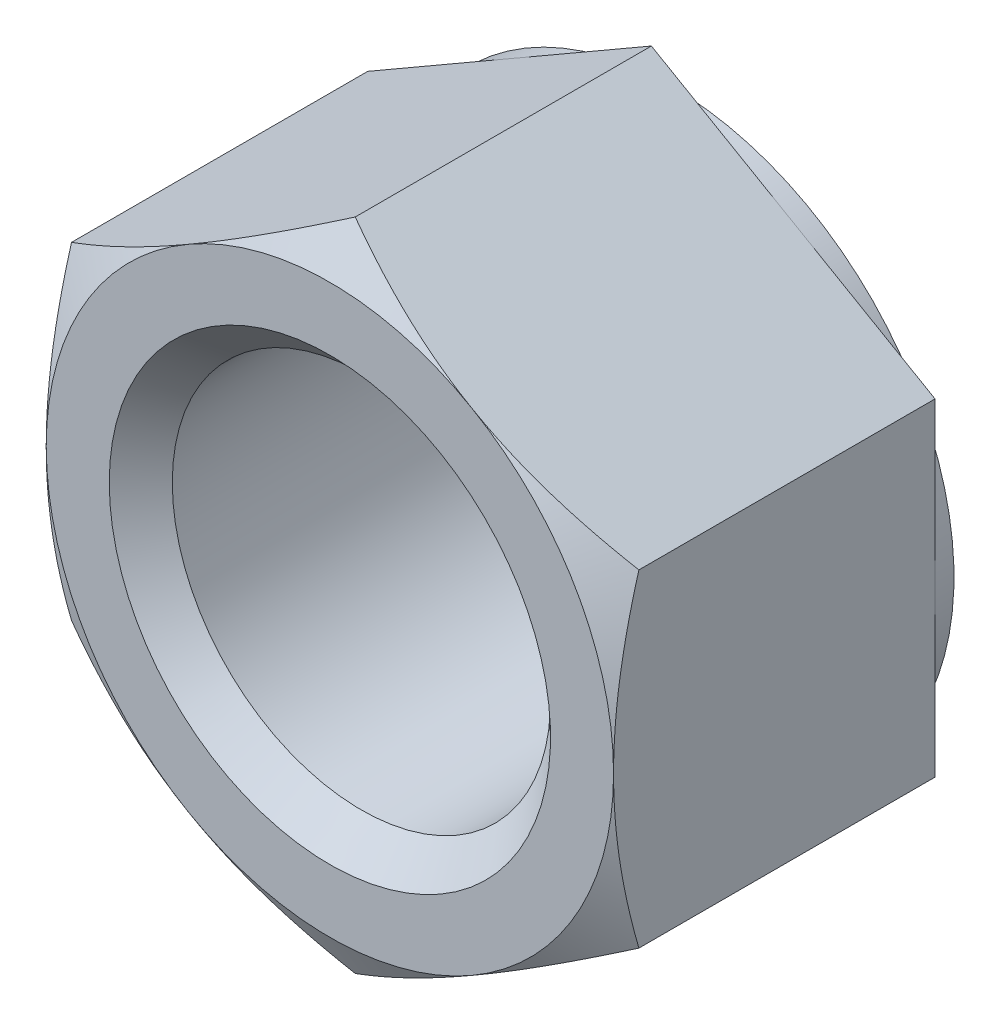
ISO-10303-21;
HEADER;
FILE_DESCRIPTION(('STEP AP214'),'2;1');
FILE_NAME('part.step','',(''),(''),'','','');
FILE_SCHEMA(('AUTOMOTIVE_DESIGN { 1 0 10303 214 1 1 1 1 }'));
ENDSEC;
DATA;
#1=APPLICATION_CONTEXT('core data for automotive mechanical design processes');
#2=APPLICATION_PROTOCOL_DEFINITION('international standard','automotive_design',2000,#1);
#3=PRODUCT_CONTEXT('',#1,'mechanical');
#4=PRODUCT('Part','Part','',(#3));
#5=PRODUCT_RELATED_PRODUCT_CATEGORY('part','',(#4));
#6=PRODUCT_DEFINITION_FORMATION('','',#4);
#7=PRODUCT_DEFINITION_CONTEXT('part definition',#1,'design');
#8=PRODUCT_DEFINITION('design','',#6,#7);
#9=PRODUCT_DEFINITION_SHAPE('','',#8);
#10=(LENGTH_UNIT() NAMED_UNIT(*) SI_UNIT(.MILLI.,.METRE.));
#11=(NAMED_UNIT(*) PLANE_ANGLE_UNIT() SI_UNIT($,.RADIAN.));
#12=(NAMED_UNIT(*) SI_UNIT($,.STERADIAN.) SOLID_ANGLE_UNIT());
#13=UNCERTAINTY_MEASURE_WITH_UNIT(LENGTH_MEASURE(1.E-05),#10,'distance_accuracy_value','');
#14=(GEOMETRIC_REPRESENTATION_CONTEXT(3) GLOBAL_UNCERTAINTY_ASSIGNED_CONTEXT((#13)) GLOBAL_UNIT_ASSIGNED_CONTEXT((#10,
#11,#12)) REPRESENTATION_CONTEXT('',''));
#15=CARTESIAN_POINT('',(0.,0.,0.));
#16=DIRECTION('',(0.,0.,1.));
#17=DIRECTION('',(1.,0.,0.));
#18=AXIS2_PLACEMENT_3D('',#15,#16,#17);
#19=CARTESIAN_POINT('',(0.,10.3923048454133,-10.8));
#20=DIRECTION('',(0.,0.,-1.));
#21=DIRECTION('',(-1.,0.,0.));
#22=AXIS2_PLACEMENT_3D('',#19,#20,#21);
#23=PLANE('',#22);
#24=CARTESIAN_POINT('',(0.,0.,-10.8));
#25=DIRECTION('',(0.,0.,-1.));
#26=DIRECTION('',(-1.,0.,0.));
#27=AXIS2_PLACEMENT_3D('',#24,#25,#26);
#28=CIRCLE('',#27,9.);
#29=CARTESIAN_POINT('',(-9.,0.,-10.8));
#30=VERTEX_POINT('',#29);
#31=EDGE_CURVE('E280',#30,#30,#28,.F.);
#32=ORIENTED_EDGE('',*,*,#31,.F.);
#33=EDGE_LOOP('',(#32));
#34=FACE_BOUND('',#33,.T.);
#35=CARTESIAN_POINT('',(0.,0.,-10.8));
#36=DIRECTION('',(0.,0.,-1.));
#37=DIRECTION('',(-1.,0.,0.));
#38=AXIS2_PLACEMENT_3D('',#35,#36,#37);
#39=CIRCLE('',#38,6.);
#40=CARTESIAN_POINT('',(-6.,0.,-10.8));
#41=VERTEX_POINT('',#40);
#42=EDGE_CURVE('E148',#41,#41,#39,.F.);
#43=ORIENTED_EDGE('',*,*,#42,.T.);
#44=EDGE_LOOP('',(#43));
#45=FACE_BOUND('',#44,.T.);
#46=ADVANCED_FACE('F33',(#34,#45),#23,.T.);
#47=CARTESIAN_POINT('',(0.,10.3923048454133,0.));
#48=DIRECTION('',(0.,0.,-1.));
#49=DIRECTION('',(-1.,0.,0.));
#50=AXIS2_PLACEMENT_3D('',#47,#48,#49);
#51=PLANE('',#50);
#52=CARTESIAN_POINT('',(0.,0.,0.));
#53=DIRECTION('',(0.,0.,-1.));
#54=DIRECTION('',(-1.,0.,0.));
#55=AXIS2_PLACEMENT_3D('',#52,#53,#54);
#56=CIRCLE('',#55,7.);
#57=CARTESIAN_POINT('',(-7.,0.,0.));
#58=VERTEX_POINT('',#57);
#59=EDGE_CURVE('E12',#58,#58,#56,.T.);
#60=ORIENTED_EDGE('',*,*,#59,.T.);
#61=EDGE_LOOP('',(#60));
#62=FACE_BOUND('',#61,.T.);
#63=CARTESIAN_POINT('',(0.,0.,0.));
#64=DIRECTION('',(0.,0.,-1.));
#65=DIRECTION('',(-1.,0.,0.));
#66=AXIS2_PLACEMENT_3D('',#63,#64,#65);
#67=CIRCLE('',#66,9.);
#68=CARTESIAN_POINT('',(-4.50000000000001,7.79422863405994,0.));
#69=VERTEX_POINT('',#68);
#70=CARTESIAN_POINT('',(-9.,0.,0.));
#71=VERTEX_POINT('',#70);
#72=EDGE_CURVE('E297',#69,#71,#67,.F.);
#73=ORIENTED_EDGE('',*,*,#72,.T.);
#74=CARTESIAN_POINT('',(-4.50000000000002,-7.79422863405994,0.));
#75=VERTEX_POINT('',#74);
#76=EDGE_CURVE('E48',#71,#75,#67,.F.);
#77=ORIENTED_EDGE('',*,*,#76,.T.);
#78=CARTESIAN_POINT('',(4.50000000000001,-7.79422863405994,0.));
#79=VERTEX_POINT('',#78);
#80=EDGE_CURVE('E153',#75,#79,#67,.F.);
#81=ORIENTED_EDGE('',*,*,#80,.T.);
#82=CARTESIAN_POINT('',(9.,0.,0.));
#83=VERTEX_POINT('',#82);
#84=EDGE_CURVE('E127',#79,#83,#67,.F.);
#85=ORIENTED_EDGE('',*,*,#84,.T.);
#86=CARTESIAN_POINT('',(0.,0.,0.));
#87=DIRECTION('',(0.,0.,1.));
#88=DIRECTION('',(1.,0.,0.));
#89=AXIS2_PLACEMENT_3D('',#86,#87,#88);
#90=CIRCLE('',#89,9.);
#91=CARTESIAN_POINT('',(4.50000000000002,7.79422863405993,0.));
#92=VERTEX_POINT('',#91);
#93=EDGE_CURVE('E139',#83,#92,#90,.T.);
#94=ORIENTED_EDGE('',*,*,#93,.T.);
#95=EDGE_CURVE('E154',#92,#69,#67,.F.);
#96=ORIENTED_EDGE('',*,*,#95,.T.);
#97=EDGE_LOOP('',(#73,#77,#81,#85,#94,#96));
#98=FACE_BOUND('',#97,.T.);
#99=ADVANCED_FACE('F151',(#62,#98),#51,.F.);
#100=CARTESIAN_POINT('',(0.,10.3923048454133,-10.8));
#101=DIRECTION('',(-0.500000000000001,0.866025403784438,0.));
#102=DIRECTION('',(-0.866025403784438,-0.500000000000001,0.));
#103=AXIS2_PLACEMENT_3D('',#100,#101,#102);
#104=PLANE('',#103);
#105=DIRECTION('',(0.,0.,1.));
#106=VECTOR('',#105,1.);
#107=CARTESIAN_POINT('',(-9.,5.19615242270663,-10.8));
#108=LINE('',#107,#106);
#109=CARTESIAN_POINT('',(-9.,5.19615242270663,-10.2));
#110=VERTEX_POINT('',#109);
#111=CARTESIAN_POINT('',(-9.,5.19615242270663,-0.803847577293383));
#112=VERTEX_POINT('',#111);
#113=EDGE_CURVE('E290',#110,#112,#108,.T.);
#114=ORIENTED_EDGE('',*,*,#113,.T.);
#115=CARTESIAN_POINT('',(-9.0002,5.19603695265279,-0.803914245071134));
#116=CARTESIAN_POINT('',(-8.80239295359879,5.31024090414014,-0.737982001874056));
#117=CARTESIAN_POINT('',(-8.60381439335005,5.42489028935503,-0.675041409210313));
#118=CARTESIAN_POINT('',(-8.20504463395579,5.65512011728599,-0.555968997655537));
#119=CARTESIAN_POINT('',(-8.00485277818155,5.77070093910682,-0.499840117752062));
#120=CARTESIAN_POINT('',(-7.6024849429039,6.00300811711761,-0.395151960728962));
#121=CARTESIAN_POINT('',(-7.4003054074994,6.11973652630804,-0.346610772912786));
#122=CARTESIAN_POINT('',(-6.99457124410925,6.35398725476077,-0.258148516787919));
#123=CARTESIAN_POINT('',(-6.79101690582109,6.47150940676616,-0.218225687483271));
#124=CARTESIAN_POINT('',(-6.38769409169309,6.70436794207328,-0.148684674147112));
#125=CARTESIAN_POINT('',(-6.187955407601,6.81968712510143,-0.118837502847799));
#126=CARTESIAN_POINT('',(-5.787584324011,7.05084147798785,-0.0687933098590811));
#127=CARTESIAN_POINT('',(-5.58695200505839,7.16667660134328,-0.0485954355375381));
#128=CARTESIAN_POINT('',(-5.18533936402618,7.39854776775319,-0.0183543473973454));
#129=CARTESIAN_POINT('',(-4.98435969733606,7.51458343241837,-0.0082996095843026));
#130=CARTESIAN_POINT('',(-4.58221540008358,7.74676155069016,0.00143766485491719));
#131=CARTESIAN_POINT('',(-4.38105077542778,7.86290400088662,0.00112052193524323));
#132=CARTESIAN_POINT('',(-4.0049673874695,8.08003584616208,-0.00916395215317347));
#133=CARTESIAN_POINT('',(-3.83002210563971,8.18104055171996,-0.017876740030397));
#134=CARTESIAN_POINT('',(-3.48054132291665,8.38281337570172,-0.0429773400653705));
#135=CARTESIAN_POINT('',(-3.30600585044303,8.48358147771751,-0.0593656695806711));
#136=CARTESIAN_POINT('',(-2.78307512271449,8.7854956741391,-0.119656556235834));
#137=CARTESIAN_POINT('',(-2.43560548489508,8.98610736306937,-0.174677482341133));
#138=CARTESIAN_POINT('',(-1.736980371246,9.3894587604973,-0.312230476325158));
#139=CARTESIAN_POINT('',(-1.38591405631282,9.59214699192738,-0.395345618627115));
#140=CARTESIAN_POINT('',(-0.689016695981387,9.99450087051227,-0.583982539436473));
#141=CARTESIAN_POINT('',(-0.343176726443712,10.1941716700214,-0.68946001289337));
#142=CARTESIAN_POINT('',(0.000200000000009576,10.3924203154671,-0.803914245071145));
#143=B_SPLINE_CURVE_WITH_KNOTS('',3,(#115,#116,#117,#118,#119,#120,#121,#122,#123,#124,#125,
#126,#127,#128,#129,#130,#131,#132,#133,#134,#135,#136,#137,#138,#139,#140,#141,#142),
.UNSPECIFIED.,.F.,.F.,(4,2,2,2,2,2,2,2,2,2,2,2,2,4),(0.,0.713219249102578,1.42674513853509,
2.14194697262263,2.85700253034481,3.55449749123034,4.25193080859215,4.94857085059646,
5.64518936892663,6.25162976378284,6.85811104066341,8.07193747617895,9.31268391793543,
10.5509947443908),.UNSPECIFIED.);
#144=EDGE_CURVE('E55',#112,#69,#143,.T.);
#145=ORIENTED_EDGE('',*,*,#144,.T.);
#146=CARTESIAN_POINT('',(0.,10.3923048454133,-0.80384757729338));
#147=VERTEX_POINT('',#146);
#148=EDGE_CURVE('E164',#69,#147,#143,.T.);
#149=ORIENTED_EDGE('',*,*,#148,.T.);
#150=DIRECTION('',(0.,0.,1.));
#151=VECTOR('',#150,1.);
#152=CARTESIAN_POINT('',(0.,10.3923048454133,-10.8));
#153=LINE('',#152,#151);
#154=CARTESIAN_POINT('',(0.,10.3923048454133,-10.2));
#155=VERTEX_POINT('',#154);
#156=EDGE_CURVE('E277',#155,#147,#153,.T.);
#157=ORIENTED_EDGE('',*,*,#156,.F.);
#158=DIRECTION('',(-0.866025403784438,-0.500000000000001,0.));
#159=VECTOR('',#158,1.);
#160=CARTESIAN_POINT('',(0.,10.3923048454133,-10.2));
#161=LINE('',#160,#159);
#162=CARTESIAN_POINT('',(-4.50000000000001,7.79422863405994,-10.2));
#163=VERTEX_POINT('',#162);
#164=EDGE_CURVE('E265',#155,#163,#161,.T.);
#165=ORIENTED_EDGE('',*,*,#164,.T.);
#166=EDGE_CURVE('E261',#163,#110,#161,.T.);
#167=ORIENTED_EDGE('',*,*,#166,.T.);
#168=EDGE_LOOP('',(#114,#145,#149,#157,#165,#167));
#169=FACE_BOUND('',#168,.T.);
#170=ADVANCED_FACE('F226',(#169),#104,.T.);
#171=CARTESIAN_POINT('',(9.,5.19615242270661,-10.8));
#172=DIRECTION('',(0.500000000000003,0.866025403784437,0.));
#173=DIRECTION('',(-0.866025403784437,0.500000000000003,0.));
#174=AXIS2_PLACEMENT_3D('',#171,#172,#173);
#175=PLANE('',#174);
#176=ORIENTED_EDGE('',*,*,#156,.T.);
#177=CARTESIAN_POINT('',(-0.000199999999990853,10.3924203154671,-0.803914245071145));
#178=CARTESIAN_POINT('',(0.197607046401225,10.2782163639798,-0.737982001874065));
#179=CARTESIAN_POINT('',(0.396185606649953,10.1635669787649,-0.675041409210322));
#180=CARTESIAN_POINT('',(0.794955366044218,9.93333715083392,-0.555968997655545));
#181=CARTESIAN_POINT('',(0.99514722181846,9.81775632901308,-0.499840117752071));
#182=CARTESIAN_POINT('',(1.39751505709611,9.58544915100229,-0.395151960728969));
#183=CARTESIAN_POINT('',(1.59969459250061,9.46872074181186,-0.346610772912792));
#184=CARTESIAN_POINT('',(2.00542875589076,9.23447001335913,-0.258148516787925));
#185=CARTESIAN_POINT('',(2.20898309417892,9.11694786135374,-0.218225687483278));
#186=CARTESIAN_POINT('',(2.61230590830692,8.88408932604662,-0.148684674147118));
#187=CARTESIAN_POINT('',(2.81204459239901,8.76877014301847,-0.118837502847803));
#188=CARTESIAN_POINT('',(3.212415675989,8.53761579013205,-0.0687933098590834));
#189=CARTESIAN_POINT('',(3.41304799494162,8.42178066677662,-0.0485954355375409));
#190=CARTESIAN_POINT('',(3.81466063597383,8.18990950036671,-0.0183543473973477));
#191=CARTESIAN_POINT('',(4.01564030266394,8.07387383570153,-0.00829960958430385));
#192=CARTESIAN_POINT('',(4.41778459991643,7.84169571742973,0.00143766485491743));
#193=CARTESIAN_POINT('',(4.61894922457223,7.72555326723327,0.00112052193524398));
#194=CARTESIAN_POINT('',(4.99503261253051,7.50842142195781,-0.00916395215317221));
#195=CARTESIAN_POINT('',(5.1699778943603,7.40741671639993,-0.0178767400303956));
#196=CARTESIAN_POINT('',(5.51945867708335,7.20564389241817,-0.0429773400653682));
#197=CARTESIAN_POINT('',(5.69399414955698,7.10487579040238,-0.059365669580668));
#198=CARTESIAN_POINT('',(6.21692487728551,6.80296159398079,-0.119656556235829));
#199=CARTESIAN_POINT('',(6.56439451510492,6.60234990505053,-0.174677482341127));
#200=CARTESIAN_POINT('',(7.26301962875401,6.19899850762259,-0.31223047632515));
#201=CARTESIAN_POINT('',(7.61408594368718,5.99631027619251,-0.395345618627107));
#202=CARTESIAN_POINT('',(8.31098330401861,5.59395639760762,-0.583982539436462));
#203=CARTESIAN_POINT('',(8.65682327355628,5.39428559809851,-0.689460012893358));
#204=CARTESIAN_POINT('',(9.0002,5.19603695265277,-0.803914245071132));
#205=B_SPLINE_CURVE_WITH_KNOTS('',3,(#177,#178,#179,#180,#181,#182,#183,#184,#185,#186,#187,
#188,#189,#190,#191,#192,#193,#194,#195,#196,#197,#198,#199,#200,#201,#202,#203,#204),
.UNSPECIFIED.,.F.,.F.,(4,2,2,2,2,2,2,2,2,2,2,2,2,4),(0.,0.713219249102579,1.42674513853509,
2.14194697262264,2.85700253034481,3.55449749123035,4.25193080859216,4.94857085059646,
5.64518936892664,6.25162976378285,6.85811104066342,8.07193747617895,9.31268391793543,
10.5509947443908),.UNSPECIFIED.);
#206=EDGE_CURVE('E161',#147,#92,#205,.T.);
#207=ORIENTED_EDGE('',*,*,#206,.T.);
#208=CARTESIAN_POINT('',(9.,5.19615242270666,-0.80384757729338));
#209=VERTEX_POINT('',#208);
#210=EDGE_CURVE('E142',#92,#209,#205,.T.);
#211=ORIENTED_EDGE('',*,*,#210,.T.);
#212=DIRECTION('',(0.,0.,1.));
#213=VECTOR('',#212,1.);
#214=CARTESIAN_POINT('',(9.,5.19615242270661,-10.8));
#215=LINE('',#214,#213);
#216=CARTESIAN_POINT('',(9.,5.19615242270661,-10.2));
#217=VERTEX_POINT('',#216);
#218=EDGE_CURVE('E160',#217,#209,#215,.T.);
#219=ORIENTED_EDGE('',*,*,#218,.F.);
#220=DIRECTION('',(-0.866025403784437,0.500000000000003,0.));
#221=VECTOR('',#220,1.);
#222=CARTESIAN_POINT('',(9.,5.19615242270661,-10.2));
#223=LINE('',#222,#221);
#224=CARTESIAN_POINT('',(4.50000000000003,7.79422863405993,-10.2));
#225=VERTEX_POINT('',#224);
#226=EDGE_CURVE('E273',#217,#225,#223,.T.);
#227=ORIENTED_EDGE('',*,*,#226,.T.);
#228=EDGE_CURVE('E269',#225,#155,#223,.T.);
#229=ORIENTED_EDGE('',*,*,#228,.T.);
#230=EDGE_LOOP('',(#176,#207,#211,#219,#227,#229));
#231=FACE_BOUND('',#230,.T.);
#232=ADVANCED_FACE('F229',(#231),#175,.T.);
#233=CARTESIAN_POINT('',(9.,5.19615242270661,-10.8));
#234=DIRECTION('',(-1.,0.,0.));
#235=DIRECTION('',(0.,0.,1.));
#236=AXIS2_PLACEMENT_3D('',#233,#234,#235);
#237=PLANE('',#236);
#238=CARTESIAN_POINT('',(9.,-13.7809619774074,-4.30674034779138));
#239=CARTESIAN_POINT('',(9.,-13.5833938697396,-4.21123885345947));
#240=CARTESIAN_POINT('',(9.,-13.385586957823,-4.11623162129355));
#241=CARTESIAN_POINT('',(9.,-12.9894450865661,-3.92731913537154));
#242=CARTESIAN_POINT('',(9.,-12.7911101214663,-3.83341389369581));
#243=CARTESIAN_POINT('',(9.,-12.1951793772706,-3.55349411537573));
#244=CARTESIAN_POINT('',(9.,-11.796721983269,-3.36930666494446));
#245=CARTESIAN_POINT('',(9.,-10.9947735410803,-3.00593915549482));
#246=CARTESIAN_POINT('',(9.,-10.5912667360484,-2.82679378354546));
#247=CARTESIAN_POINT('',(9.,-9.78093737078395,-2.47619472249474));
#248=CARTESIAN_POINT('',(9.,-9.37411498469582,-2.30474063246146));
#249=CARTESIAN_POINT('',(9.,-8.55145586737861,-1.96953872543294));
#250=CARTESIAN_POINT('',(9.,-8.13556978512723,-1.80591135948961));
#251=CARTESIAN_POINT('',(9.,-7.2988933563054,-1.491471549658));
#252=CARTESIAN_POINT('',(9.,-6.87810247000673,-1.3406605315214));
#253=CARTESIAN_POINT('',(9.,-6.03180598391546,-1.05590655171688));
#254=CARTESIAN_POINT('',(9.,-5.60631258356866,-0.921927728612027));
#255=CARTESIAN_POINT('',(9.,-4.74929212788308,-0.675187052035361));
#256=CARTESIAN_POINT('',(9.,-4.31776702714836,-0.56241848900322));
#257=CARTESIAN_POINT('',(9.,-3.44831631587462,-0.363581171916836));
#258=CARTESIAN_POINT('',(9.,-3.01038903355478,-0.277519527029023));
#259=CARTESIAN_POINT('',(9.,-2.34964451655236,-0.172766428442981));
#260=CARTESIAN_POINT('',(9.,-2.12872697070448,-0.141903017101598));
#261=CARTESIAN_POINT('',(9.,-1.68585612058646,-0.0888965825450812));
#262=CARTESIAN_POINT('',(9.,-1.46390292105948,-0.0667526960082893));
#263=CARTESIAN_POINT('',(9.,-1.02066876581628,-0.0317812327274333));
#264=CARTESIAN_POINT('',(9.,-0.799392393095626,-0.0188958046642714));
#265=CARTESIAN_POINT('',(9.,-0.356492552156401,-0.00250938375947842));
#266=CARTESIAN_POINT('',(9.,-0.134869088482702,0.000991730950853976));
#267=CARTESIAN_POINT('',(9.,0.308263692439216,-0.001473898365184));
#268=CARTESIAN_POINT('',(9.,0.529773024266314,-0.0074379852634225));
#269=CARTESIAN_POINT('',(9.,0.972347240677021,-0.0286857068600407));
#270=CARTESIAN_POINT('',(9.,1.19341210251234,-0.0439698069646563));
#271=CARTESIAN_POINT('',(9.,1.72920526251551,-0.0919895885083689));
#272=CARTESIAN_POINT('',(9.,2.04352190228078,-0.12939492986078));
#273=CARTESIAN_POINT('',(9.,2.66974660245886,-0.220970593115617));
#274=CARTESIAN_POINT('',(9.,2.98165398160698,-0.275145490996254));
#275=CARTESIAN_POINT('',(9.,3.60280284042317,-0.398338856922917));
#276=CARTESIAN_POINT('',(9.,3.91204150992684,-0.467371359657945));
#277=CARTESIAN_POINT('',(9.,4.5273372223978,-0.618173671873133));
#278=CARTESIAN_POINT('',(9.,4.83339456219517,-0.699942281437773));
#279=CARTESIAN_POINT('',(9.,5.44986573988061,-0.876398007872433));
#280=CARTESIAN_POINT('',(9.,5.7602024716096,-0.971352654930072));
#281=CARTESIAN_POINT('',(9.,6.3775956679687,-1.17064401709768));
#282=CARTESIAN_POINT('',(9.,6.68465423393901,-1.27497426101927));
#283=CARTESIAN_POINT('',(9.,7.29425898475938,-1.49086177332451));
#284=CARTESIAN_POINT('',(9.,7.59682084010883,-1.60237505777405));
#285=CARTESIAN_POINT('',(9.,8.19959709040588,-1.83194682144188));
#286=CARTESIAN_POINT('',(9.,8.49981047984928,-1.95000794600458));
#287=CARTESIAN_POINT('',(9.,8.79893322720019,-2.07069526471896));
#288=B_SPLINE_CURVE_WITH_KNOTS('',3,(#238,#239,#240,#241,#242,#243,#244,#245,#246,#247,#248,
#249,#250,#251,#252,#253,#254,#255,#256,#257,#258,#259,#260,#261,#262,#263,#264,#265,#266,#267,
#268,#269,#270,#271,#272,#273,#274,#275,#276,#277,#278,#279,#280,#281,#282,#283,#284,#285,#286,
#287),.UNSPECIFIED.,.F.,.F.,(4,2,2,2,2,2,2,2,2,2,2,2,2,2,2,2,2,2,2,2,2,2,2,2,4),(0.,
0.658317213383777,1.31664163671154,2.63350462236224,3.95790348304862,5.28223322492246,
6.62282162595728,7.96355896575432,9.30138955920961,10.6387962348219,11.9765586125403,
12.6456025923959,13.3145803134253,13.9793407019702,14.644092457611,15.3086576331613,
15.9732559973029,16.9223307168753,17.8716646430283,18.82189928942,19.7720444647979,
20.745479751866,21.7182482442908,22.6855413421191,23.6532281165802),.UNSPECIFIED.);
#289=CARTESIAN_POINT('',(9.,-5.19615242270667,-0.80384757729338));
#290=VERTEX_POINT('',#289);
#291=EDGE_CURVE('E123',#290,#83,#288,.T.);
#292=ORIENTED_EDGE('',*,*,#291,.F.);
#293=DIRECTION('',(0.,0.,1.));
#294=VECTOR('',#293,1.);
#295=CARTESIAN_POINT('',(9.,-5.19615242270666,-10.8));
#296=LINE('',#295,#294);
#297=CARTESIAN_POINT('',(9.,-5.19615242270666,-10.2));
#298=VERTEX_POINT('',#297);
#299=EDGE_CURVE('E282',#298,#290,#296,.T.);
#300=ORIENTED_EDGE('',*,*,#299,.F.);
#301=DIRECTION('',(0.,-1.,0.));
#302=VECTOR('',#301,1.);
#303=CARTESIAN_POINT('',(9.,5.19615242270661,-10.2));
#304=LINE('',#303,#302);
#305=CARTESIAN_POINT('',(9.,0.,-10.2));
#306=VERTEX_POINT('',#305);
#307=EDGE_CURVE('E274',#306,#298,#304,.T.);
#308=ORIENTED_EDGE('',*,*,#307,.F.);
#309=EDGE_CURVE('E276',#217,#306,#304,.T.);
#310=ORIENTED_EDGE('',*,*,#309,.F.);
#311=ORIENTED_EDGE('',*,*,#218,.T.);
#312=EDGE_CURVE('E136',#83,#209,#288,.T.);
#313=ORIENTED_EDGE('',*,*,#312,.F.);
#314=EDGE_LOOP('',(#292,#300,#308,#310,#311,#313));
#315=FACE_BOUND('',#314,.T.);
#316=ADVANCED_FACE('F157',(#315),#237,.F.);
#317=CARTESIAN_POINT('',(0.,-10.3923048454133,-10.8));
#318=DIRECTION('',(0.500000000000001,-0.866025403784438,0.));
#319=DIRECTION('',(0.866025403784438,0.500000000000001,0.));
#320=AXIS2_PLACEMENT_3D('',#317,#318,#319);
#321=PLANE('',#320);
#322=ORIENTED_EDGE('',*,*,#299,.T.);
#323=CARTESIAN_POINT('',(9.0002,-5.19603695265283,-0.803914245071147));
#324=CARTESIAN_POINT('',(8.80239295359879,-5.31024090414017,-0.737982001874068));
#325=CARTESIAN_POINT('',(8.60381439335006,-5.42489028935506,-0.675041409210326));
#326=CARTESIAN_POINT('',(8.20504463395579,-5.65512011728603,-0.55596899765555));
#327=CARTESIAN_POINT('',(8.00485277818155,-5.77070093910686,-0.499840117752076));
#328=CARTESIAN_POINT('',(7.6024849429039,-6.00300811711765,-0.395151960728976));
#329=CARTESIAN_POINT('',(7.4003054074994,-6.11973652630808,-0.346610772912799));
#330=CARTESIAN_POINT('',(6.99457124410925,-6.35398725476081,-0.258148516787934));
#331=CARTESIAN_POINT('',(6.79101690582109,-6.4715094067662,-0.218225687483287));
#332=CARTESIAN_POINT('',(6.38769409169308,-6.70436794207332,-0.148684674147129));
#333=CARTESIAN_POINT('',(6.18795540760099,-6.81968712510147,-0.118837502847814));
#334=CARTESIAN_POINT('',(5.787584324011,-7.05084147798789,-0.0687933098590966));
#335=CARTESIAN_POINT('',(5.58695200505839,-7.16667660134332,-0.0485954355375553));
#336=CARTESIAN_POINT('',(5.18533936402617,-7.39854776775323,-0.0183543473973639));
#337=CARTESIAN_POINT('',(4.98435969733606,-7.51458343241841,-0.00829960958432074));
#338=CARTESIAN_POINT('',(4.58221540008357,-7.74676155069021,0.00143766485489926));
#339=CARTESIAN_POINT('',(4.38105077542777,-7.86290400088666,0.00112052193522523));
#340=CARTESIAN_POINT('',(4.00496738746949,-8.08003584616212,-0.00916395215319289));
#341=CARTESIAN_POINT('',(3.8300221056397,-8.18104055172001,-0.0178767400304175));
#342=CARTESIAN_POINT('',(3.48054132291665,-8.38281337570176,-0.0429773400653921));
#343=CARTESIAN_POINT('',(3.30600585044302,-8.48358147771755,-0.0593656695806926));
#344=CARTESIAN_POINT('',(2.78307512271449,-8.78549567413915,-0.119656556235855));
#345=CARTESIAN_POINT('',(2.43560548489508,-8.9861073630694,-0.174677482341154));
#346=CARTESIAN_POINT('',(1.736980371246,-9.38945876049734,-0.312230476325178));
#347=CARTESIAN_POINT('',(1.38591405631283,-9.59214699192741,-0.395345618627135));
#348=CARTESIAN_POINT('',(0.689016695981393,-9.9945008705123,-0.583982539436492));
#349=CARTESIAN_POINT('',(0.34317672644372,-10.1941716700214,-0.689460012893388));
#350=CARTESIAN_POINT('',(-0.00020000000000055,-10.3924203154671,-0.803914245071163));
#351=B_SPLINE_CURVE_WITH_KNOTS('',3,(#323,#324,#325,#326,#327,#328,#329,#330,#331,#332,#333,
#334,#335,#336,#337,#338,#339,#340,#341,#342,#343,#344,#345,#346,#347,#348,#349,#350),
.UNSPECIFIED.,.F.,.F.,(4,2,2,2,2,2,2,2,2,2,2,2,2,4),(0.,0.713219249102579,1.42674513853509,
2.14194697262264,2.85700253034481,3.55449749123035,4.25193080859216,4.94857085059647,
5.64518936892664,6.25162976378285,6.85811104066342,8.07193747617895,9.31268391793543,
10.5509947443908),.UNSPECIFIED.);
#352=EDGE_CURVE('E130',#290,#79,#351,.T.);
#353=ORIENTED_EDGE('',*,*,#352,.T.);
#354=CARTESIAN_POINT('',(0.,-10.3923048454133,-0.80384757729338));
#355=VERTEX_POINT('',#354);
#356=EDGE_CURVE('E172',#79,#355,#351,.T.);
#357=ORIENTED_EDGE('',*,*,#356,.T.);
#358=DIRECTION('',(0.,0.,1.));
#359=VECTOR('',#358,1.);
#360=CARTESIAN_POINT('',(0.,-10.3923048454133,-10.8));
#361=LINE('',#360,#359);
#362=CARTESIAN_POINT('',(0.,-10.3923048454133,-10.2));
#363=VERTEX_POINT('',#362);
#364=EDGE_CURVE('E284',#363,#355,#361,.T.);
#365=ORIENTED_EDGE('',*,*,#364,.F.);
#366=DIRECTION('',(0.866025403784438,0.500000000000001,0.));
#367=VECTOR('',#366,1.);
#368=CARTESIAN_POINT('',(0.,-10.3923048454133,-10.2));
#369=LINE('',#368,#367);
#370=CARTESIAN_POINT('',(4.50000000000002,-7.79422863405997,-10.2));
#371=VERTEX_POINT('',#370);
#372=EDGE_CURVE('E266',#363,#371,#369,.T.);
#373=ORIENTED_EDGE('',*,*,#372,.T.);
#374=EDGE_CURVE('E270',#371,#298,#369,.T.);
#375=ORIENTED_EDGE('',*,*,#374,.T.);
#376=EDGE_LOOP('',(#322,#353,#357,#365,#373,#375));
#377=FACE_BOUND('',#376,.T.);
#378=ADVANCED_FACE('F219',(#377),#321,.T.);
#379=CARTESIAN_POINT('',(-9.,-5.19615242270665,-10.8));
#380=DIRECTION('',(-0.500000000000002,-0.866025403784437,0.));
#381=DIRECTION('',(0.866025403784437,-0.500000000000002,0.));
#382=AXIS2_PLACEMENT_3D('',#379,#380,#381);
#383=PLANE('',#382);
#384=ORIENTED_EDGE('',*,*,#364,.T.);
#385=CARTESIAN_POINT('',(0.000199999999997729,-10.3924203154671,-0.803914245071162));
#386=CARTESIAN_POINT('',(-0.197607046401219,-10.2782163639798,-0.737982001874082));
#387=CARTESIAN_POINT('',(-0.396185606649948,-10.1635669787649,-0.675041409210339));
#388=CARTESIAN_POINT('',(-0.794955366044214,-9.93333715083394,-0.555968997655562));
#389=CARTESIAN_POINT('',(-0.995147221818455,-9.81775632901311,-0.499840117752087));
#390=CARTESIAN_POINT('',(-1.3975150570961,-9.58544915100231,-0.395151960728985));
#391=CARTESIAN_POINT('',(-1.5996945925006,-9.46872074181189,-0.346610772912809));
#392=CARTESIAN_POINT('',(-2.00542875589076,-9.23447001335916,-0.258148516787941));
#393=CARTESIAN_POINT('',(-2.20898309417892,-9.11694786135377,-0.218225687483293));
#394=CARTESIAN_POINT('',(-2.61230590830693,-8.88408932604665,-0.148684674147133));
#395=CARTESIAN_POINT('',(-2.81204459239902,-8.7687701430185,-0.118837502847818));
#396=CARTESIAN_POINT('',(-3.21241567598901,-8.53761579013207,-0.0687933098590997));
#397=CARTESIAN_POINT('',(-3.41304799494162,-8.42178066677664,-0.0485954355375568));
#398=CARTESIAN_POINT('',(-3.81466063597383,-8.18990950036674,-0.0183543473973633));
#399=CARTESIAN_POINT('',(-4.01564030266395,-8.07387383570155,-0.00829960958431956));
#400=CARTESIAN_POINT('',(-4.41778459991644,-7.84169571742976,0.00143766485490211));
#401=CARTESIAN_POINT('',(-4.61894922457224,-7.7255532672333,0.00112052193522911));
#402=CARTESIAN_POINT('',(-4.99503261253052,-7.50842142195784,-0.00916395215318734));
#403=CARTESIAN_POINT('',(-5.16997789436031,-7.40741671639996,-0.0178767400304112));
#404=CARTESIAN_POINT('',(-5.51945867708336,-7.2056438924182,-0.0429773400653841));
#405=CARTESIAN_POINT('',(-5.69399414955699,-7.10487579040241,-0.0593656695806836));
#406=CARTESIAN_POINT('',(-6.21692487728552,-6.80296159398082,-0.119656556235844));
#407=CARTESIAN_POINT('',(-6.56439451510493,-6.60234990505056,-0.174677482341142));
#408=CARTESIAN_POINT('',(-7.26301962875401,-6.19899850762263,-0.312230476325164));
#409=CARTESIAN_POINT('',(-7.61408594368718,-5.99631027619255,-0.39534561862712));
#410=CARTESIAN_POINT('',(-8.31098330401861,-5.59395639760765,-0.583982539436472));
#411=CARTESIAN_POINT('',(-8.65682327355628,-5.39428559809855,-0.689460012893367));
#412=CARTESIAN_POINT('',(-9.0002,-5.19603695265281,-0.803914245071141));
#413=B_SPLINE_CURVE_WITH_KNOTS('',3,(#385,#386,#387,#388,#389,#390,#391,#392,#393,#394,#395,
#396,#397,#398,#399,#400,#401,#402,#403,#404,#405,#406,#407,#408,#409,#410,#411,#412),
.UNSPECIFIED.,.F.,.F.,(4,2,2,2,2,2,2,2,2,2,2,2,2,4),(0.,0.713219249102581,1.4267451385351,
2.14194697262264,2.85700253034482,3.55449749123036,4.25193080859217,4.94857085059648,
5.64518936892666,6.25162976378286,6.85811104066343,8.07193747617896,9.31268391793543,
10.5509947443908),.UNSPECIFIED.);
#414=EDGE_CURVE('E213',#355,#75,#413,.T.);
#415=ORIENTED_EDGE('',*,*,#414,.T.);
#416=CARTESIAN_POINT('',(-9.,-5.19615242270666,-0.80384757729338));
#417=VERTEX_POINT('',#416);
#418=EDGE_CURVE('E205',#75,#417,#413,.T.);
#419=ORIENTED_EDGE('',*,*,#418,.T.);
#420=DIRECTION('',(0.,0.,1.));
#421=VECTOR('',#420,1.);
#422=CARTESIAN_POINT('',(-9.,-5.19615242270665,-10.8));
#423=LINE('',#422,#421);
#424=CARTESIAN_POINT('',(-9.,-5.19615242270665,-10.2));
#425=VERTEX_POINT('',#424);
#426=EDGE_CURVE('E287',#425,#417,#423,.T.);
#427=ORIENTED_EDGE('',*,*,#426,.F.);
#428=DIRECTION('',(0.866025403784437,-0.500000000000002,0.));
#429=VECTOR('',#428,1.);
#430=CARTESIAN_POINT('',(-9.,-5.19615242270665,-10.2));
#431=LINE('',#430,#429);
#432=CARTESIAN_POINT('',(-4.50000000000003,-7.79422863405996,-10.2));
#433=VERTEX_POINT('',#432);
#434=EDGE_CURVE('E256',#425,#433,#431,.T.);
#435=ORIENTED_EDGE('',*,*,#434,.T.);
#436=EDGE_CURVE('E262',#433,#363,#431,.T.);
#437=ORIENTED_EDGE('',*,*,#436,.T.);
#438=EDGE_LOOP('',(#384,#415,#419,#427,#435,#437));
#439=FACE_BOUND('',#438,.T.);
#440=ADVANCED_FACE('F215',(#439),#383,.T.);
#441=CARTESIAN_POINT('',(-9.,5.19615242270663,-10.8));
#442=DIRECTION('',(-1.,0.,0.));
#443=DIRECTION('',(0.,0.,1.));
#444=AXIS2_PLACEMENT_3D('',#441,#442,#443);
#445=PLANE('',#444);
#446=ORIENTED_EDGE('',*,*,#426,.T.);
#447=CARTESIAN_POINT('',(-9.,-13.7809619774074,-4.30674034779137));
#448=CARTESIAN_POINT('',(-9.,-13.5833938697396,-4.21123885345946));
#449=CARTESIAN_POINT('',(-9.,-13.385586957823,-4.11623162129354));
#450=CARTESIAN_POINT('',(-9.,-12.9894450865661,-3.92731913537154));
#451=CARTESIAN_POINT('',(-9.,-12.7911101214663,-3.8334138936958));
#452=CARTESIAN_POINT('',(-9.,-12.1951793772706,-3.55349411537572));
#453=CARTESIAN_POINT('',(-9.,-11.796721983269,-3.36930666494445));
#454=CARTESIAN_POINT('',(-9.,-10.9947735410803,-3.00593915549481));
#455=CARTESIAN_POINT('',(-9.,-10.5912667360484,-2.82679378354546));
#456=CARTESIAN_POINT('',(-9.,-9.78093737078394,-2.47619472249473));
#457=CARTESIAN_POINT('',(-9.,-9.3741149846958,-2.30474063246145));
#458=CARTESIAN_POINT('',(-9.,-8.55145586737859,-1.96953872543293));
#459=CARTESIAN_POINT('',(-9.,-8.13556978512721,-1.80591135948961));
#460=CARTESIAN_POINT('',(-9.,-7.29889335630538,-1.491471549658));
#461=CARTESIAN_POINT('',(-9.,-6.87810247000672,-1.3406605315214));
#462=CARTESIAN_POINT('',(-9.,-6.03180598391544,-1.05590655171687));
#463=CARTESIAN_POINT('',(-9.,-5.60631258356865,-0.921927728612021));
#464=CARTESIAN_POINT('',(-9.,-4.74929212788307,-0.675187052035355));
#465=CARTESIAN_POINT('',(-9.,-4.31776702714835,-0.562418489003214));
#466=CARTESIAN_POINT('',(-9.,-3.44831631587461,-0.363581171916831));
#467=CARTESIAN_POINT('',(-9.,-3.01038903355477,-0.277519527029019));
#468=CARTESIAN_POINT('',(-9.,-2.34964451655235,-0.172766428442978));
#469=CARTESIAN_POINT('',(-9.,-2.12872697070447,-0.141903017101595));
#470=CARTESIAN_POINT('',(-9.,-1.68585612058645,-0.0888965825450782));
#471=CARTESIAN_POINT('',(-9.,-1.46390292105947,-0.066752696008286));
#472=CARTESIAN_POINT('',(-9.,-1.02066876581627,-0.0317812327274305));
#473=CARTESIAN_POINT('',(-9.,-0.799392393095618,-0.0188958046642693));
#474=CARTESIAN_POINT('',(-9.,-0.356492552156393,-0.00250938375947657));
#475=CARTESIAN_POINT('',(-9.,-0.134869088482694,0.000991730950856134));
#476=CARTESIAN_POINT('',(-9.,0.308263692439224,-0.00147389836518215));
#477=CARTESIAN_POINT('',(-9.,0.529773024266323,-0.00743798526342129));
#478=CARTESIAN_POINT('',(-9.,0.97234724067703,-0.0286857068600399));
#479=CARTESIAN_POINT('',(-9.,1.19341210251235,-0.0439698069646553));
#480=CARTESIAN_POINT('',(-9.,1.72920526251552,-0.091989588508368));
#481=CARTESIAN_POINT('',(-9.,2.04352190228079,-0.12939492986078));
#482=CARTESIAN_POINT('',(-9.,2.66974660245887,-0.220970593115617));
#483=CARTESIAN_POINT('',(-9.,2.981653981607,-0.275145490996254));
#484=CARTESIAN_POINT('',(-9.,3.60280284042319,-0.398338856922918));
#485=CARTESIAN_POINT('',(-9.,3.91204150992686,-0.467371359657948));
#486=CARTESIAN_POINT('',(-9.,4.52733722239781,-0.618173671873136));
#487=CARTESIAN_POINT('',(-9.,4.83339456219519,-0.699942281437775));
#488=CARTESIAN_POINT('',(-9.,5.44986573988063,-0.876398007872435));
#489=CARTESIAN_POINT('',(-9.,5.76020247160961,-0.971352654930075));
#490=CARTESIAN_POINT('',(-9.,6.37759566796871,-1.17064401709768));
#491=CARTESIAN_POINT('',(-9.,6.68465423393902,-1.27497426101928));
#492=CARTESIAN_POINT('',(-9.,7.29425898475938,-1.49086177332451));
#493=CARTESIAN_POINT('',(-9.,7.59682084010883,-1.60237505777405));
#494=CARTESIAN_POINT('',(-9.,8.19959709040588,-1.83194682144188));
#495=CARTESIAN_POINT('',(-9.,8.49981047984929,-1.95000794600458));
#496=CARTESIAN_POINT('',(-9.,8.7989332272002,-2.07069526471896));
#497=B_SPLINE_CURVE_WITH_KNOTS('',3,(#447,#448,#449,#450,#451,#452,#453,#454,#455,#456,#457,
#458,#459,#460,#461,#462,#463,#464,#465,#466,#467,#468,#469,#470,#471,#472,#473,#474,#475,#476,
#477,#478,#479,#480,#481,#482,#483,#484,#485,#486,#487,#488,#489,#490,#491,#492,#493,#494,#495,
#496),.UNSPECIFIED.,.F.,.F.,(4,2,2,2,2,2,2,2,2,2,2,2,2,2,2,2,2,2,2,2,2,2,2,2,4),(0.,
0.658317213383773,1.31664163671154,2.63350462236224,3.95790348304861,5.28223322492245,
6.62282162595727,7.96355896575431,9.3013895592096,10.6387962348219,11.9765586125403,
12.6456025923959,13.3145803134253,13.9793407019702,14.644092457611,15.3086576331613,
15.9732559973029,16.9223307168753,17.8716646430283,18.82189928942,19.7720444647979,
20.745479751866,21.7182482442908,22.6855413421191,23.6532281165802),.UNSPECIFIED.);
#498=EDGE_CURVE('E214',#417,#71,#497,.T.);
#499=ORIENTED_EDGE('',*,*,#498,.T.);
#500=EDGE_CURVE('E147',#71,#112,#497,.T.);
#501=ORIENTED_EDGE('',*,*,#500,.T.);
#502=ORIENTED_EDGE('',*,*,#113,.F.);
#503=DIRECTION('',(0.,-1.,0.));
#504=VECTOR('',#503,1.);
#505=CARTESIAN_POINT('',(-9.,5.19615242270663,-10.2));
#506=LINE('',#505,#504);
#507=CARTESIAN_POINT('',(-9.,0.,-10.2));
#508=VERTEX_POINT('',#507);
#509=EDGE_CURVE('E296',#110,#508,#506,.T.);
#510=ORIENTED_EDGE('',*,*,#509,.T.);
#511=EDGE_CURVE('E294',#508,#425,#506,.T.);
#512=ORIENTED_EDGE('',*,*,#511,.T.);
#513=EDGE_LOOP('',(#446,#499,#501,#502,#510,#512));
#514=FACE_BOUND('',#513,.T.);
#515=ADVANCED_FACE('F218',(#514),#445,.T.);
#516=CARTESIAN_POINT('',(0.,20.3923048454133,-10.2));
#517=DIRECTION('',(0.,0.,-1.));
#518=DIRECTION('',(-1.,0.,0.));
#519=AXIS2_PLACEMENT_3D('',#516,#517,#518);
#520=PLANE('',#519);
#521=ORIENTED_EDGE('',*,*,#309,.T.);
#522=CARTESIAN_POINT('',(0.,0.,-10.2));
#523=DIRECTION('',(0.,0.,1.));
#524=DIRECTION('',(1.,0.,0.));
#525=AXIS2_PLACEMENT_3D('',#522,#523,#524);
#526=CIRCLE('',#525,9.);
#527=EDGE_CURVE('E253',#306,#225,#526,.T.);
#528=ORIENTED_EDGE('',*,*,#527,.T.);
#529=ORIENTED_EDGE('',*,*,#226,.F.);
#530=EDGE_LOOP('',(#521,#528,#529));
#531=FACE_BOUND('',#530,.T.);
#532=ADVANCED_FACE('F224',(#531),#520,.T.);
#533=ORIENTED_EDGE('',*,*,#307,.T.);
#534=ORIENTED_EDGE('',*,*,#374,.F.);
#535=EDGE_CURVE('E258',#371,#306,#526,.T.);
#536=ORIENTED_EDGE('',*,*,#535,.T.);
#537=EDGE_LOOP('',(#533,#534,#536));
#538=FACE_BOUND('',#537,.T.);
#539=ADVANCED_FACE('F315',(#538),#520,.T.);
#540=EDGE_CURVE('E257',#225,#163,#526,.T.);
#541=ORIENTED_EDGE('',*,*,#540,.T.);
#542=ORIENTED_EDGE('',*,*,#164,.F.);
#543=ORIENTED_EDGE('',*,*,#228,.F.);
#544=EDGE_LOOP('',(#541,#542,#543));
#545=FACE_BOUND('',#544,.T.);
#546=ADVANCED_FACE('F355',(#545),#520,.T.);
#547=ORIENTED_EDGE('',*,*,#436,.F.);
#548=EDGE_CURVE('E321',#433,#371,#526,.T.);
#549=ORIENTED_EDGE('',*,*,#548,.T.);
#550=ORIENTED_EDGE('',*,*,#372,.F.);
#551=EDGE_LOOP('',(#547,#549,#550));
#552=FACE_BOUND('',#551,.T.);
#553=ADVANCED_FACE('F350',(#552),#520,.T.);
#554=EDGE_CURVE('E358',#163,#508,#526,.T.);
#555=ORIENTED_EDGE('',*,*,#554,.T.);
#556=ORIENTED_EDGE('',*,*,#509,.F.);
#557=ORIENTED_EDGE('',*,*,#166,.F.);
#558=EDGE_LOOP('',(#555,#556,#557));
#559=FACE_BOUND('',#558,.T.);
#560=ADVANCED_FACE('F343',(#559),#520,.T.);
#561=CARTESIAN_POINT('',(0.,0.,0.));
#562=DIRECTION('',(0.,0.,1.));
#563=DIRECTION('',(1.,0.,0.));
#564=AXIS2_PLACEMENT_3D('',#561,#562,#563);
#565=CYLINDRICAL_SURFACE('',#564,9.);
#566=ORIENTED_EDGE('',*,*,#31,.T.);
#567=EDGE_LOOP('',(#566));
#568=FACE_BOUND('',#567,.T.);
#569=ORIENTED_EDGE('',*,*,#540,.F.);
#570=ORIENTED_EDGE('',*,*,#527,.F.);
#571=ORIENTED_EDGE('',*,*,#535,.F.);
#572=ORIENTED_EDGE('',*,*,#548,.F.);
#573=EDGE_CURVE('E361',#508,#433,#526,.T.);
#574=ORIENTED_EDGE('',*,*,#573,.F.);
#575=ORIENTED_EDGE('',*,*,#554,.F.);
#576=EDGE_LOOP('',(#569,#570,#571,#572,#574,#575));
#577=FACE_BOUND('',#576,.T.);
#578=ADVANCED_FACE('F246',(#568,#577),#565,.T.);
#579=ORIENTED_EDGE('',*,*,#511,.F.);
#580=ORIENTED_EDGE('',*,*,#573,.T.);
#581=ORIENTED_EDGE('',*,*,#434,.F.);
#582=EDGE_LOOP('',(#579,#580,#581));
#583=FACE_BOUND('',#582,.T.);
#584=ADVANCED_FACE('F193',(#583),#520,.T.);
#585=CARTESIAN_POINT('',(0.,0.,0.));
#586=DIRECTION('',(0.,0.,-1.));
#587=DIRECTION('',(-1.,0.,0.));
#588=AXIS2_PLACEMENT_3D('',#585,#586,#587);
#589=CONICAL_SURFACE('',#588,9.,1.0471975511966);
#590=ORIENTED_EDGE('',*,*,#500,.F.);
#591=ORIENTED_EDGE('',*,*,#72,.F.);
#592=ORIENTED_EDGE('',*,*,#144,.F.);
#593=EDGE_LOOP('',(#590,#591,#592));
#594=FACE_BOUND('',#593,.T.);
#595=ADVANCED_FACE('F331',(#594),#589,.T.);
#596=ORIENTED_EDGE('',*,*,#95,.F.);
#597=ORIENTED_EDGE('',*,*,#206,.F.);
#598=ORIENTED_EDGE('',*,*,#148,.F.);
#599=EDGE_LOOP('',(#596,#597,#598));
#600=FACE_BOUND('',#599,.T.);
#601=ADVANCED_FACE('F192',(#600),#589,.T.);
#602=ORIENTED_EDGE('',*,*,#93,.F.);
#603=ORIENTED_EDGE('',*,*,#312,.T.);
#604=ORIENTED_EDGE('',*,*,#210,.F.);
#605=EDGE_LOOP('',(#602,#603,#604));
#606=FACE_BOUND('',#605,.T.);
#607=ADVANCED_FACE('F140',(#606),#589,.T.);
#608=ORIENTED_EDGE('',*,*,#291,.T.);
#609=ORIENTED_EDGE('',*,*,#84,.F.);
#610=ORIENTED_EDGE('',*,*,#352,.F.);
#611=EDGE_LOOP('',(#608,#609,#610));
#612=FACE_BOUND('',#611,.T.);
#613=ADVANCED_FACE('F125',(#612),#589,.T.);
#614=ORIENTED_EDGE('',*,*,#80,.F.);
#615=ORIENTED_EDGE('',*,*,#414,.F.);
#616=ORIENTED_EDGE('',*,*,#356,.F.);
#617=EDGE_LOOP('',(#614,#615,#616));
#618=FACE_BOUND('',#617,.T.);
#619=ADVANCED_FACE('F191',(#618),#589,.T.);
#620=ORIENTED_EDGE('',*,*,#76,.F.);
#621=ORIENTED_EDGE('',*,*,#498,.F.);
#622=ORIENTED_EDGE('',*,*,#418,.F.);
#623=EDGE_LOOP('',(#620,#621,#622));
#624=FACE_BOUND('',#623,.T.);
#625=ADVANCED_FACE('F185',(#624),#589,.T.);
#626=CARTESIAN_POINT('',(0.,0.,-25.0375057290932));
#627=DIRECTION('',(0.,0.,1.));
#628=DIRECTION('',(1.,0.,0.));
#629=AXIS2_PLACEMENT_3D('',#626,#627,#628);
#630=CYLINDRICAL_SURFACE('',#629,6.);
#631=CARTESIAN_POINT('',(0.,0.,-0.999999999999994));
#632=DIRECTION('',(0.,0.,-1.));
#633=DIRECTION('',(-1.,0.,0.));
#634=AXIS2_PLACEMENT_3D('',#631,#632,#633);
#635=CIRCLE('',#634,6.);
#636=CARTESIAN_POINT('',(-6.,0.,-0.999999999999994));
#637=VERTEX_POINT('',#636);
#638=EDGE_CURVE('E41',#637,#637,#635,.F.);
#639=ORIENTED_EDGE('',*,*,#638,.T.);
#640=EDGE_LOOP('',(#639));
#641=FACE_BOUND('',#640,.T.);
#642=ORIENTED_EDGE('',*,*,#42,.F.);
#643=EDGE_LOOP('',(#642));
#644=FACE_BOUND('',#643,.T.);
#645=ADVANCED_FACE('F190',(#641,#644),#630,.F.);
#646=CARTESIAN_POINT('',(0.,0.,-0.999999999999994));
#647=DIRECTION('',(0.,0.,1.));
#648=DIRECTION('',(1.,0.,0.));
#649=AXIS2_PLACEMENT_3D('',#646,#647,#648);
#650=CONICAL_SURFACE('',#649,6.,0.78539816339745);
#651=ORIENTED_EDGE('',*,*,#59,.F.);
#652=EDGE_LOOP('',(#651));
#653=FACE_BOUND('',#652,.T.);
#654=ORIENTED_EDGE('',*,*,#638,.F.);
#655=EDGE_LOOP('',(#654));
#656=FACE_BOUND('',#655,.T.);
#657=ADVANCED_FACE('F35',(#653,#656),#650,.F.);
#658=CLOSED_SHELL('',(#46,#99,#170,#232,#316,#378,#440,#515,#532,#539,#546,#553,#560,#578,#584,
#595,#601,#607,#613,#619,#625,#645,#657));
#659=MANIFOLD_SOLID_BREP('B2',#658);
#660=ADVANCED_BREP_SHAPE_REPRESENTATION('',(#18,#659),#14);
#661=SHAPE_DEFINITION_REPRESENTATION(#9,#660);
ENDSEC;
END-ISO-10303-21;
